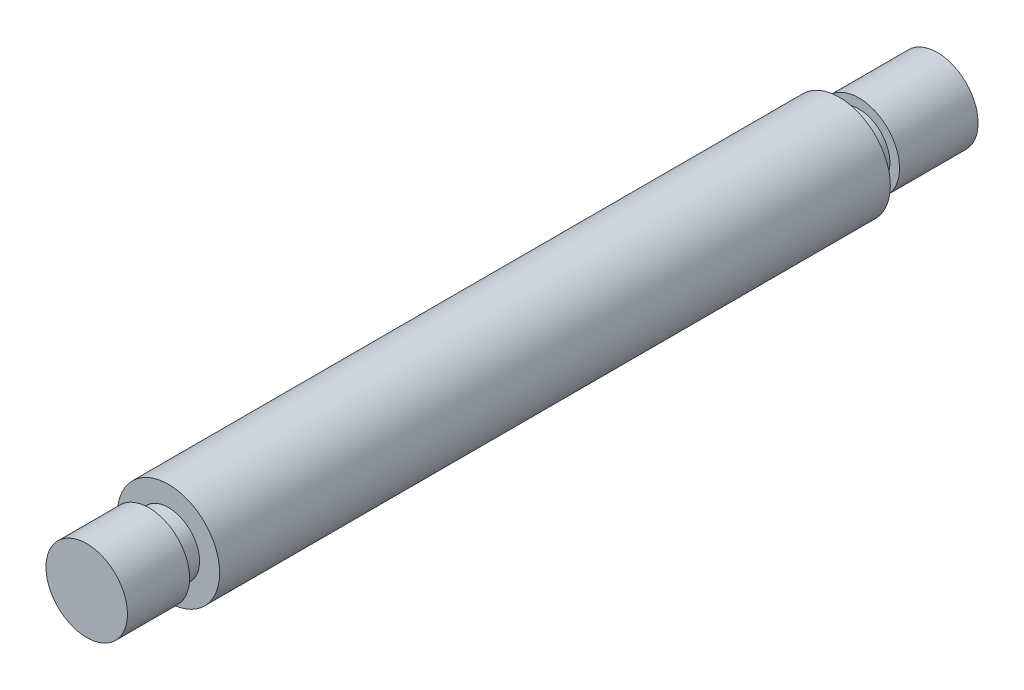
ISO-10303-21;
HEADER;
FILE_DESCRIPTION(('STEP AP214'),'2;1');
FILE_NAME('part.step','',(''),(''),'','','');
FILE_SCHEMA(('AUTOMOTIVE_DESIGN { 1 0 10303 214 1 1 1 1 }'));
ENDSEC;
DATA;
#1=APPLICATION_CONTEXT('core data for automotive mechanical design processes');
#2=APPLICATION_PROTOCOL_DEFINITION('international standard','automotive_design',2000,#1);
#3=PRODUCT_CONTEXT('',#1,'mechanical');
#4=PRODUCT('Part','Part','',(#3));
#5=PRODUCT_RELATED_PRODUCT_CATEGORY('part','',(#4));
#6=PRODUCT_DEFINITION_FORMATION('','',#4);
#7=PRODUCT_DEFINITION_CONTEXT('part definition',#1,'design');
#8=PRODUCT_DEFINITION('design','',#6,#7);
#9=PRODUCT_DEFINITION_SHAPE('','',#8);
#10=(LENGTH_UNIT() NAMED_UNIT(*) SI_UNIT(.MILLI.,.METRE.));
#11=(NAMED_UNIT(*) PLANE_ANGLE_UNIT() SI_UNIT($,.RADIAN.));
#12=(NAMED_UNIT(*) SI_UNIT($,.STERADIAN.) SOLID_ANGLE_UNIT());
#13=UNCERTAINTY_MEASURE_WITH_UNIT(LENGTH_MEASURE(1.E-05),#10,'distance_accuracy_value','');
#14=(GEOMETRIC_REPRESENTATION_CONTEXT(3) GLOBAL_UNCERTAINTY_ASSIGNED_CONTEXT((#13)) GLOBAL_UNIT_ASSIGNED_CONTEXT((#10,
#11,#12)) REPRESENTATION_CONTEXT('',''));
#15=CARTESIAN_POINT('',(0.,0.,0.));
#16=DIRECTION('',(0.,0.,1.));
#17=DIRECTION('',(1.,0.,0.));
#18=AXIS2_PLACEMENT_3D('',#15,#16,#17);
#19=CARTESIAN_POINT('',(0.,0.,-59.69));
#20=DIRECTION('',(0.,0.,1.));
#21=DIRECTION('',(1.,0.,0.));
#22=AXIS2_PLACEMENT_3D('',#19,#20,#21);
#23=CYLINDRICAL_SURFACE('',#22,3.96875);
#24=CARTESIAN_POINT('',(0.,0.,0.));
#25=DIRECTION('',(0.,0.,1.));
#26=DIRECTION('',(1.,0.,0.));
#27=AXIS2_PLACEMENT_3D('',#24,#25,#26);
#28=CIRCLE('',#27,3.96875);
#29=CARTESIAN_POINT('',(3.96875,0.,0.));
#30=VERTEX_POINT('',#29);
#31=EDGE_CURVE('E51',#30,#30,#28,.T.);
#32=CARTESIAN_POINT('',(0.,0.,-52.07));
#33=DIRECTION('',(0.,0.,-1.));
#34=DIRECTION('',(-1.,0.,0.));
#35=AXIS2_PLACEMENT_3D('',#32,#33,#34);
#36=CIRCLE('',#35,3.96875);
#37=CARTESIAN_POINT('',(3.96875,0.,-52.07));
#38=VERTEX_POINT('',#37);
#39=EDGE_CURVE('E10',#38,#38,#36,.T.);
#40=CARTESIAN_POINT('',(3.96875,0.,0.));
#41=CARTESIAN_POINT('',(3.96875,0.,-0.542395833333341));
#42=CARTESIAN_POINT('',(3.96875,0.,-1.08479166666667));
#43=CARTESIAN_POINT('',(3.96875,0.,-2.16958333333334));
#44=CARTESIAN_POINT('',(3.96875,0.,-2.71197916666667));
#45=CARTESIAN_POINT('',(3.96875,0.,-3.79677083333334));
#46=CARTESIAN_POINT('',(3.96875,0.,-4.33916666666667));
#47=CARTESIAN_POINT('',(3.96875,0.,-5.42395833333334));
#48=CARTESIAN_POINT('',(3.96875,0.,-5.96635416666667));
#49=CARTESIAN_POINT('',(3.96875,0.,-7.05114583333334));
#50=CARTESIAN_POINT('',(3.96875,0.,-7.59354166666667));
#51=CARTESIAN_POINT('',(3.96875,0.,-8.67833333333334));
#52=CARTESIAN_POINT('',(3.96875,0.,-9.22072916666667));
#53=CARTESIAN_POINT('',(3.96875,0.,-10.3055208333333));
#54=CARTESIAN_POINT('',(3.96875,0.,-10.8479166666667));
#55=CARTESIAN_POINT('',(3.96875,0.,-11.9327083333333));
#56=CARTESIAN_POINT('',(3.96875,0.,-12.4751041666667));
#57=CARTESIAN_POINT('',(3.96875,0.,-13.5598958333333));
#58=CARTESIAN_POINT('',(3.96875,0.,-14.1022916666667));
#59=CARTESIAN_POINT('',(3.96875,0.,-15.1870833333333));
#60=CARTESIAN_POINT('',(3.96875,0.,-15.7294791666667));
#61=CARTESIAN_POINT('',(3.96875,0.,-16.8142708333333));
#62=CARTESIAN_POINT('',(3.96875,0.,-17.3566666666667));
#63=CARTESIAN_POINT('',(3.96875,0.,-18.4414583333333));
#64=CARTESIAN_POINT('',(3.96875,0.,-18.9838541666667));
#65=CARTESIAN_POINT('',(3.96875,0.,-20.0686458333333));
#66=CARTESIAN_POINT('',(3.96875,0.,-20.6110416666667));
#67=CARTESIAN_POINT('',(3.96875,0.,-21.6958333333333));
#68=CARTESIAN_POINT('',(3.96875,0.,-22.2382291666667));
#69=CARTESIAN_POINT('',(3.96875,0.,-23.3230208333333));
#70=CARTESIAN_POINT('',(3.96875,0.,-23.8654166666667));
#71=CARTESIAN_POINT('',(3.96875,0.,-24.9502083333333));
#72=CARTESIAN_POINT('',(3.96875,0.,-25.4926041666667));
#73=CARTESIAN_POINT('',(3.96875,0.,-26.5773958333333));
#74=CARTESIAN_POINT('',(3.96875,0.,-27.1197916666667));
#75=CARTESIAN_POINT('',(3.96875,0.,-28.2045833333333));
#76=CARTESIAN_POINT('',(3.96875,0.,-28.7469791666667));
#77=CARTESIAN_POINT('',(3.96875,0.,-29.8317708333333));
#78=CARTESIAN_POINT('',(3.96875,0.,-30.3741666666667));
#79=CARTESIAN_POINT('',(3.96875,0.,-31.4589583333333));
#80=CARTESIAN_POINT('',(3.96875,0.,-32.0013541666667));
#81=CARTESIAN_POINT('',(3.96875,0.,-33.0861458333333));
#82=CARTESIAN_POINT('',(3.96875,0.,-33.6285416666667));
#83=CARTESIAN_POINT('',(3.96875,0.,-34.7133333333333));
#84=CARTESIAN_POINT('',(3.96875,0.,-35.2557291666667));
#85=CARTESIAN_POINT('',(3.96875,0.,-36.3405208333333));
#86=CARTESIAN_POINT('',(3.96875,0.,-36.8829166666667));
#87=CARTESIAN_POINT('',(3.96875,0.,-37.9677083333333));
#88=CARTESIAN_POINT('',(3.96875,0.,-38.5101041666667));
#89=CARTESIAN_POINT('',(3.96875,0.,-39.5948958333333));
#90=CARTESIAN_POINT('',(3.96875,0.,-40.1372916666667));
#91=CARTESIAN_POINT('',(3.96875,0.,-41.2220833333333));
#92=CARTESIAN_POINT('',(3.96875,0.,-41.7644791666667));
#93=CARTESIAN_POINT('',(3.96875,0.,-42.8492708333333));
#94=CARTESIAN_POINT('',(3.96875,0.,-43.3916666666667));
#95=CARTESIAN_POINT('',(3.96875,0.,-44.4764583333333));
#96=CARTESIAN_POINT('',(3.96875,0.,-45.0188541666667));
#97=CARTESIAN_POINT('',(3.96875,0.,-46.1036458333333));
#98=CARTESIAN_POINT('',(3.96875,0.,-46.6460416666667));
#99=CARTESIAN_POINT('',(3.96875,0.,-47.7308333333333));
#100=CARTESIAN_POINT('',(3.96875,0.,-48.2732291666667));
#101=CARTESIAN_POINT('',(3.96875,0.,-49.3580208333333));
#102=CARTESIAN_POINT('',(3.96875,0.,-49.9004166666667));
#103=CARTESIAN_POINT('',(3.96875,0.,-50.9852083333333));
#104=CARTESIAN_POINT('',(3.96875,0.,-51.5276041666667));
#105=CARTESIAN_POINT('',(3.96875,0.,-52.07));
#106=B_SPLINE_CURVE_WITH_KNOTS('',3,(#40,#41,#42,#43,#44,#45,#46,#47,#48,#49,#50,#51,#52,#53,
#54,#55,#56,#57,#58,#59,#60,#61,#62,#63,#64,#65,#66,#67,#68,#69,#70,#71,#72,#73,#74,#75,#76,#77,
#78,#79,#80,#81,#82,#83,#84,#85,#86,#87,#88,#89,#90,#91,#92,#93,#94,#95,#96,#97,#98,#99,#100,
#101,#102,#103,#104,#105),.UNSPECIFIED.,.F.,.F.,(4,2,2,2,2,2,2,2,2,2,2,2,2,2,2,2,2,2,2,2,2,2,2,
2,2,2,2,2,2,2,2,2,4),(0.,1.6271875,3.254375,4.8815625,6.50875,8.1359375,9.763125,11.3903125,
13.0175,14.6446875,16.271875,17.8990625,19.52625,21.1534375,22.780625,24.4078125,26.035,
27.6621875,29.289375,30.9165625,32.54375,34.1709375,35.798125,37.4253125,39.0525,40.6796875,
42.306875,43.9340625,45.56125,47.1884375,48.815625,50.4428125,52.07),.UNSPECIFIED.);
#107=EDGE_CURVE('BSEAM28',#30,#38,#106,.T.);
#108=ORIENTED_EDGE('',*,*,#31,.F.);
#109=ORIENTED_EDGE('',*,*,#39,.F.);
#110=ORIENTED_EDGE('',*,*,#107,.T.);
#111=ORIENTED_EDGE('',*,*,#107,.F.);
#112=EDGE_LOOP('',(#108,#110,#109,#111));
#113=FACE_BOUND('',#112,.T.);
#114=ADVANCED_FACE('F28',(#113),#23,.T.);
#115=CARTESIAN_POINT('',(3.96875,0.,-52.07));
#116=DIRECTION('',(0.,0.,-1.));
#117=DIRECTION('',(-1.,0.,0.));
#118=AXIS2_PLACEMENT_3D('',#115,#116,#117);
#119=PLANE('',#118);
#120=ORIENTED_EDGE('',*,*,#39,.T.);
#121=EDGE_LOOP('',(#120));
#122=FACE_BOUND('',#121,.T.);
#123=CARTESIAN_POINT('',(0.,0.,-52.07));
#124=DIRECTION('',(0.,0.,-1.));
#125=DIRECTION('',(-1.,0.,0.));
#126=AXIS2_PLACEMENT_3D('',#123,#124,#125);
#127=CIRCLE('',#126,2.413);
#128=CARTESIAN_POINT('',(-2.413,0.,-52.07));
#129=VERTEX_POINT('',#128);
#130=EDGE_CURVE('E35',#129,#129,#127,.T.);
#131=ORIENTED_EDGE('',*,*,#130,.F.);
#132=EDGE_LOOP('',(#131));
#133=FACE_BOUND('',#132,.T.);
#134=ADVANCED_FACE('F77',(#122,#133),#119,.T.);
#135=CARTESIAN_POINT('',(0.,0.,-59.69));
#136=DIRECTION('',(0.,0.,-1.));
#137=DIRECTION('',(-1.,0.,0.));
#138=AXIS2_PLACEMENT_3D('',#135,#136,#137);
#139=CYLINDRICAL_SURFACE('',#138,2.413);
#140=ORIENTED_EDGE('',*,*,#130,.T.);
#141=EDGE_LOOP('',(#140));
#142=FACE_BOUND('',#141,.T.);
#143=CARTESIAN_POINT('',(0.,0.,-53.594));
#144=DIRECTION('',(0.,0.,-1.));
#145=DIRECTION('',(-1.,0.,0.));
#146=AXIS2_PLACEMENT_3D('',#143,#144,#145);
#147=CIRCLE('',#146,2.413);
#148=CARTESIAN_POINT('',(-2.413,0.,-53.594));
#149=VERTEX_POINT('',#148);
#150=EDGE_CURVE('E39',#149,#149,#147,.T.);
#151=ORIENTED_EDGE('',*,*,#150,.F.);
#152=EDGE_LOOP('',(#151));
#153=FACE_BOUND('',#152,.T.);
#154=ADVANCED_FACE('F82',(#142,#153),#139,.T.);
#155=CARTESIAN_POINT('',(2.413,0.,-53.594));
#156=DIRECTION('',(0.,0.,1.));
#157=DIRECTION('',(1.,0.,0.));
#158=AXIS2_PLACEMENT_3D('',#155,#156,#157);
#159=PLANE('',#158);
#160=ORIENTED_EDGE('',*,*,#150,.T.);
#161=EDGE_LOOP('',(#160));
#162=FACE_BOUND('',#161,.T.);
#163=CARTESIAN_POINT('',(0.,0.,-53.594));
#164=DIRECTION('',(0.,0.,-1.));
#165=DIRECTION('',(-1.,0.,0.));
#166=AXIS2_PLACEMENT_3D('',#163,#164,#165);
#167=CIRCLE('',#166,3.1623);
#168=CARTESIAN_POINT('',(-3.1623,0.,-53.594));
#169=VERTEX_POINT('',#168);
#170=EDGE_CURVE('E43',#169,#169,#167,.T.);
#171=ORIENTED_EDGE('',*,*,#170,.F.);
#172=EDGE_LOOP('',(#171));
#173=FACE_BOUND('',#172,.T.);
#174=ADVANCED_FACE('F95',(#162,#173),#159,.T.);
#175=CARTESIAN_POINT('',(0.,0.,-59.69));
#176=DIRECTION('',(0.,0.,-1.));
#177=DIRECTION('',(-1.,0.,0.));
#178=AXIS2_PLACEMENT_3D('',#175,#176,#177);
#179=CYLINDRICAL_SURFACE('',#178,3.1623);
#180=ORIENTED_EDGE('',*,*,#170,.T.);
#181=EDGE_LOOP('',(#180));
#182=FACE_BOUND('',#181,.T.);
#183=CARTESIAN_POINT('',(0.,0.,-59.69));
#184=DIRECTION('',(0.,0.,-1.));
#185=DIRECTION('',(-1.,0.,0.));
#186=AXIS2_PLACEMENT_3D('',#183,#184,#185);
#187=CIRCLE('',#186,3.1623);
#188=CARTESIAN_POINT('',(-3.1623,0.,-59.69));
#189=VERTEX_POINT('',#188);
#190=EDGE_CURVE('E48',#189,#189,#187,.T.);
#191=ORIENTED_EDGE('',*,*,#190,.F.);
#192=EDGE_LOOP('',(#191));
#193=FACE_BOUND('',#192,.T.);
#194=ADVANCED_FACE('F90',(#182,#193),#179,.T.);
#195=CARTESIAN_POINT('',(0.,0.,-59.69));
#196=DIRECTION('',(0.,0.,-1.));
#197=DIRECTION('',(-1.,0.,0.));
#198=AXIS2_PLACEMENT_3D('',#195,#196,#197);
#199=PLANE('',#198);
#200=ORIENTED_EDGE('',*,*,#190,.T.);
#201=EDGE_LOOP('',(#200));
#202=FACE_BOUND('',#201,.T.);
#203=ADVANCED_FACE('F87',(#202),#199,.T.);
#204=CARTESIAN_POINT('',(7.62,0.,0.));
#205=DIRECTION('',(0.,0.,1.));
#206=DIRECTION('',(1.,0.,0.));
#207=AXIS2_PLACEMENT_3D('',#204,#205,#206);
#208=PLANE('',#207);
#209=CARTESIAN_POINT('',(0.,0.,0.));
#210=DIRECTION('',(0.,0.,-1.));
#211=DIRECTION('',(-1.,0.,0.));
#212=AXIS2_PLACEMENT_3D('',#209,#210,#211);
#213=CIRCLE('',#212,2.413);
#214=CARTESIAN_POINT('',(-2.413,0.,0.));
#215=VERTEX_POINT('',#214);
#216=EDGE_CURVE('E54',#215,#215,#213,.T.);
#217=ORIENTED_EDGE('',*,*,#216,.T.);
#218=EDGE_LOOP('',(#217));
#219=FACE_BOUND('',#218,.T.);
#220=ORIENTED_EDGE('',*,*,#31,.T.);
#221=EDGE_LOOP('',(#220));
#222=FACE_BOUND('',#221,.T.);
#223=ADVANCED_FACE('F89',(#219,#222),#208,.T.);
#224=CARTESIAN_POINT('',(0.,0.,0.));
#225=DIRECTION('',(0.,0.,-1.));
#226=DIRECTION('',(-1.,0.,0.));
#227=AXIS2_PLACEMENT_3D('',#224,#225,#226);
#228=CYLINDRICAL_SURFACE('',#227,2.413);
#229=CARTESIAN_POINT('',(0.,0.,1.524));
#230=DIRECTION('',(0.,0.,-1.));
#231=DIRECTION('',(-1.,0.,0.));
#232=AXIS2_PLACEMENT_3D('',#229,#230,#231);
#233=CIRCLE('',#232,2.413);
#234=CARTESIAN_POINT('',(-2.413,0.,1.524));
#235=VERTEX_POINT('',#234);
#236=EDGE_CURVE('E57',#235,#235,#233,.T.);
#237=ORIENTED_EDGE('',*,*,#236,.T.);
#238=EDGE_LOOP('',(#237));
#239=FACE_BOUND('',#238,.T.);
#240=ORIENTED_EDGE('',*,*,#216,.F.);
#241=EDGE_LOOP('',(#240));
#242=FACE_BOUND('',#241,.T.);
#243=ADVANCED_FACE('F104',(#239,#242),#228,.T.);
#244=CARTESIAN_POINT('',(2.413,0.,1.524));
#245=DIRECTION('',(0.,0.,-1.));
#246=DIRECTION('',(-1.,0.,0.));
#247=AXIS2_PLACEMENT_3D('',#244,#245,#246);
#248=PLANE('',#247);
#249=CARTESIAN_POINT('',(0.,0.,1.524));
#250=DIRECTION('',(0.,0.,-1.));
#251=DIRECTION('',(-1.,0.,0.));
#252=AXIS2_PLACEMENT_3D('',#249,#250,#251);
#253=CIRCLE('',#252,3.1623);
#254=CARTESIAN_POINT('',(-3.1623,0.,1.524));
#255=VERTEX_POINT('',#254);
#256=EDGE_CURVE('E60',#255,#255,#253,.T.);
#257=ORIENTED_EDGE('',*,*,#256,.T.);
#258=EDGE_LOOP('',(#257));
#259=FACE_BOUND('',#258,.T.);
#260=ORIENTED_EDGE('',*,*,#236,.F.);
#261=EDGE_LOOP('',(#260));
#262=FACE_BOUND('',#261,.T.);
#263=ADVANCED_FACE('F74',(#259,#262),#248,.T.);
#264=CARTESIAN_POINT('',(0.,0.,0.));
#265=DIRECTION('',(0.,0.,-1.));
#266=DIRECTION('',(-1.,0.,0.));
#267=AXIS2_PLACEMENT_3D('',#264,#265,#266);
#268=CYLINDRICAL_SURFACE('',#267,3.1623);
#269=CARTESIAN_POINT('',(0.,0.,6.34999999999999));
#270=DIRECTION('',(0.,0.,-1.));
#271=DIRECTION('',(-1.,0.,0.));
#272=AXIS2_PLACEMENT_3D('',#269,#270,#271);
#273=CIRCLE('',#272,3.1623);
#274=CARTESIAN_POINT('',(-3.1623,0.,6.34999999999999));
#275=VERTEX_POINT('',#274);
#276=EDGE_CURVE('E63',#275,#275,#273,.T.);
#277=ORIENTED_EDGE('',*,*,#276,.T.);
#278=EDGE_LOOP('',(#277));
#279=FACE_BOUND('',#278,.T.);
#280=ORIENTED_EDGE('',*,*,#256,.F.);
#281=EDGE_LOOP('',(#280));
#282=FACE_BOUND('',#281,.T.);
#283=ADVANCED_FACE('F67',(#279,#282),#268,.T.);
#284=CARTESIAN_POINT('',(0.,0.,6.34999999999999));
#285=DIRECTION('',(0.,0.,1.));
#286=DIRECTION('',(1.,0.,0.));
#287=AXIS2_PLACEMENT_3D('',#284,#285,#286);
#288=PLANE('',#287);
#289=ORIENTED_EDGE('',*,*,#276,.F.);
#290=EDGE_LOOP('',(#289));
#291=FACE_BOUND('',#290,.T.);
#292=ADVANCED_FACE('F30',(#291),#288,.T.);
#293=CLOSED_SHELL('',(#114,#134,#154,#174,#194,#203,#223,#243,#263,#283,#292));
#294=MANIFOLD_SOLID_BREP('B2',#293);
#295=ADVANCED_BREP_SHAPE_REPRESENTATION('',(#18,#294),#14);
#296=SHAPE_DEFINITION_REPRESENTATION(#9,#295);
ENDSEC;
END-ISO-10303-21;
